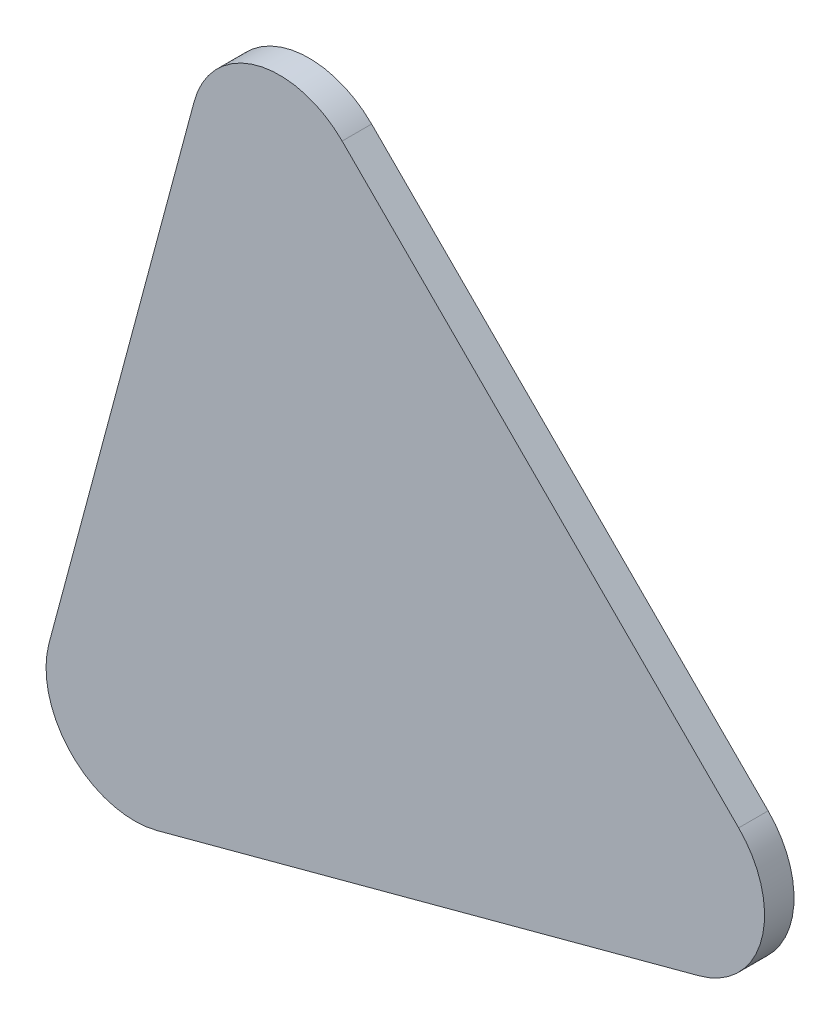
from build123d import *

# Parameters (mm, degrees)
BOSS_EXTRUDE1_DEPTH = 1
FILLET1_R           = 3


with BuildPart() as part:
    # Sketch2 → Boss-Extrude1 (new body)
    with BuildSketch(Plane.XY):
        Polygon((0, 0), (20.800611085, -20.800611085), (-7.613552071, -28.414163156), align=None)
    extrude(amount=BOSS_EXTRUDE1_DEPTH)

    # Fillet1
    fillet1_edges = [part.edges().sort_by_distance(p)[0] for p in [
        (0, 0, 0.5),
        (20.800611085, -20.800611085, 0.5),
        (-7.613552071, -28.414163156, 0.5),
    ]]
    fillet(fillet1_edges, radius=FILLET1_R)


solid = part.part
